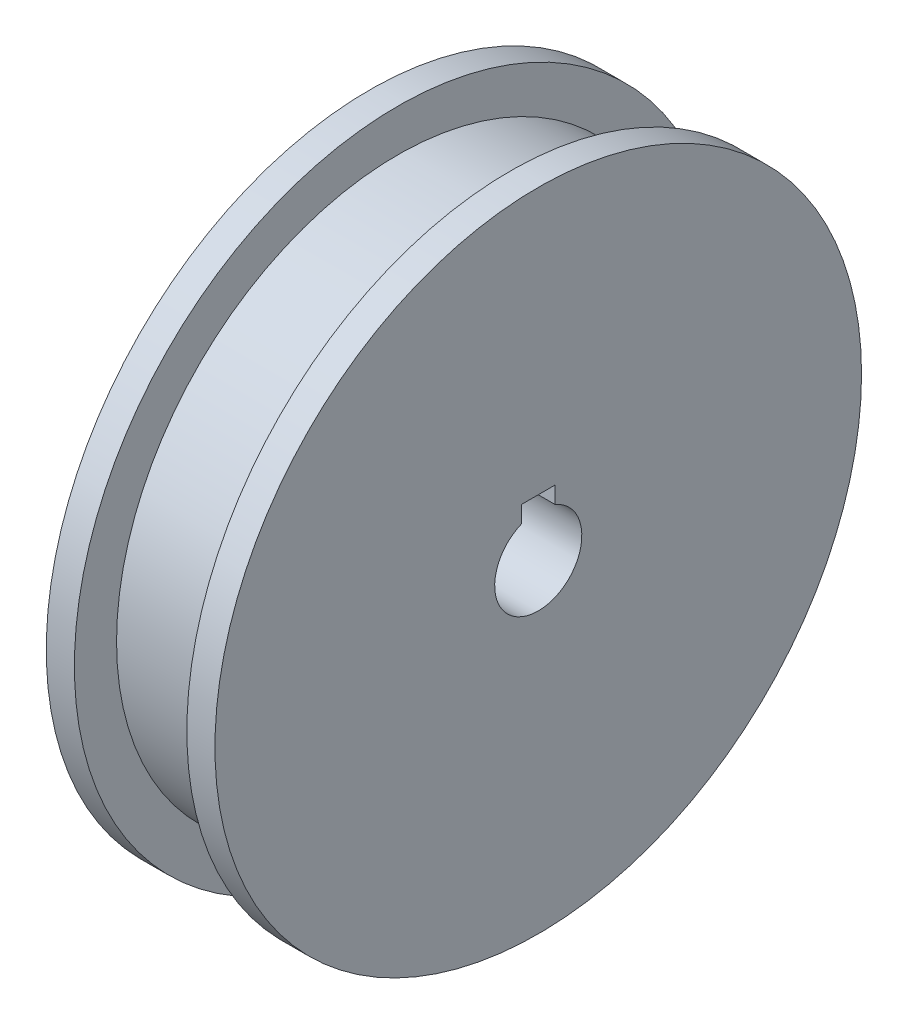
ISO-10303-21;
HEADER;
FILE_DESCRIPTION(('STEP AP214'),'2;1');
FILE_NAME('part.step','',(''),(''),'','','');
FILE_SCHEMA(('AUTOMOTIVE_DESIGN { 1 0 10303 214 1 1 1 1 }'));
ENDSEC;
DATA;
#1=APPLICATION_CONTEXT('core data for automotive mechanical design processes');
#2=APPLICATION_PROTOCOL_DEFINITION('international standard','automotive_design',2000,#1);
#3=PRODUCT_CONTEXT('',#1,'mechanical');
#4=PRODUCT('Part','Part','',(#3));
#5=PRODUCT_RELATED_PRODUCT_CATEGORY('part','',(#4));
#6=PRODUCT_DEFINITION_FORMATION('','',#4);
#7=PRODUCT_DEFINITION_CONTEXT('part definition',#1,'design');
#8=PRODUCT_DEFINITION('design','',#6,#7);
#9=PRODUCT_DEFINITION_SHAPE('','',#8);
#10=(LENGTH_UNIT() NAMED_UNIT(*) SI_UNIT(.MILLI.,.METRE.));
#11=(NAMED_UNIT(*) PLANE_ANGLE_UNIT() SI_UNIT($,.RADIAN.));
#12=(NAMED_UNIT(*) SI_UNIT($,.STERADIAN.) SOLID_ANGLE_UNIT());
#13=UNCERTAINTY_MEASURE_WITH_UNIT(LENGTH_MEASURE(1.E-05),#10,'distance_accuracy_value','');
#14=(GEOMETRIC_REPRESENTATION_CONTEXT(3) GLOBAL_UNCERTAINTY_ASSIGNED_CONTEXT((#13)) GLOBAL_UNIT_ASSIGNED_CONTEXT((#10,
#11,#12)) REPRESENTATION_CONTEXT('',''));
#15=CARTESIAN_POINT('',(0.,0.,0.));
#16=DIRECTION('',(0.,0.,1.));
#17=DIRECTION('',(1.,0.,0.));
#18=AXIS2_PLACEMENT_3D('',#15,#16,#17);
#19=CARTESIAN_POINT('',(3.,0.,0.));
#20=DIRECTION('',(-1.,0.,0.));
#21=DIRECTION('',(0.,0.,1.));
#22=AXIS2_PLACEMENT_3D('',#19,#20,#21);
#23=CYLINDRICAL_SURFACE('',#22,10.);
#24=CARTESIAN_POINT('',(2.,0.,0.));
#25=DIRECTION('',(1.,0.,0.));
#26=DIRECTION('',(0.,0.,-1.));
#27=AXIS2_PLACEMENT_3D('',#24,#25,#26);
#28=CIRCLE('',#27,10.);
#29=CARTESIAN_POINT('',(2.,0.,-10.));
#30=VERTEX_POINT('',#29);
#31=EDGE_CURVE('E42',#30,#30,#28,.T.);
#32=ORIENTED_EDGE('',*,*,#31,.F.);
#33=EDGE_LOOP('',(#32));
#34=FACE_BOUND('',#33,.T.);
#35=CARTESIAN_POINT('',(-2.,0.,0.));
#36=DIRECTION('',(-1.,0.,0.));
#37=DIRECTION('',(0.,0.,1.));
#38=AXIS2_PLACEMENT_3D('',#35,#36,#37);
#39=CIRCLE('',#38,10.);
#40=CARTESIAN_POINT('',(-2.,0.,10.));
#41=VERTEX_POINT('',#40);
#42=EDGE_CURVE('E11',#41,#41,#39,.T.);
#43=ORIENTED_EDGE('',*,*,#42,.F.);
#44=EDGE_LOOP('',(#43));
#45=FACE_BOUND('',#44,.T.);
#46=ADVANCED_FACE('F35',(#34,#45),#23,.T.);
#47=CARTESIAN_POINT('',(2.,0.,0.));
#48=DIRECTION('',(1.,0.,0.));
#49=DIRECTION('',(0.,0.,-1.));
#50=AXIS2_PLACEMENT_3D('',#47,#48,#49);
#51=CYLINDRICAL_SURFACE('',#50,11.5);
#52=CARTESIAN_POINT('',(2.,0.,0.));
#53=DIRECTION('',(1.,0.,0.));
#54=DIRECTION('',(0.,0.,-1.));
#55=AXIS2_PLACEMENT_3D('',#52,#53,#54);
#56=CIRCLE('',#55,11.5);
#57=CARTESIAN_POINT('',(2.,0.,-11.5));
#58=VERTEX_POINT('',#57);
#59=EDGE_CURVE('E118',#58,#58,#56,.T.);
#60=ORIENTED_EDGE('',*,*,#59,.T.);
#61=EDGE_LOOP('',(#60));
#62=FACE_BOUND('',#61,.T.);
#63=CARTESIAN_POINT('',(3.,0.,0.));
#64=DIRECTION('',(1.,0.,0.));
#65=DIRECTION('',(0.,0.,-1.));
#66=AXIS2_PLACEMENT_3D('',#63,#64,#65);
#67=CIRCLE('',#66,11.5);
#68=CARTESIAN_POINT('',(3.,0.,-11.5));
#69=VERTEX_POINT('',#68);
#70=EDGE_CURVE('E115',#69,#69,#67,.T.);
#71=ORIENTED_EDGE('',*,*,#70,.F.);
#72=EDGE_LOOP('',(#71));
#73=FACE_BOUND('',#72,.T.);
#74=ADVANCED_FACE('F130',(#62,#73),#51,.T.);
#75=CARTESIAN_POINT('',(2.,0.,0.));
#76=DIRECTION('',(1.,0.,0.));
#77=DIRECTION('',(0.,0.,-1.));
#78=AXIS2_PLACEMENT_3D('',#75,#76,#77);
#79=PLANE('',#78);
#80=ORIENTED_EDGE('',*,*,#31,.T.);
#81=EDGE_LOOP('',(#80));
#82=FACE_BOUND('',#81,.T.);
#83=ORIENTED_EDGE('',*,*,#59,.F.);
#84=EDGE_LOOP('',(#83));
#85=FACE_BOUND('',#84,.T.);
#86=ADVANCED_FACE('F125',(#82,#85),#79,.F.);
#87=CARTESIAN_POINT('',(3.,0.,0.));
#88=DIRECTION('',(1.,0.,0.));
#89=DIRECTION('',(0.,0.,-1.));
#90=AXIS2_PLACEMENT_3D('',#87,#88,#89);
#91=PLANE('',#90);
#92=DIRECTION('',(0.,-1.,0.));
#93=VECTOR('',#92,1.);
#94=CARTESIAN_POINT('',(3.,2.02916059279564,0.6));
#95=LINE('',#94,#93);
#96=CARTESIAN_POINT('',(3.,2.02916059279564,0.6));
#97=VERTEX_POINT('',#96);
#98=CARTESIAN_POINT('',(3.,1.42916059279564,0.6));
#99=VERTEX_POINT('',#98);
#100=EDGE_CURVE('E49',#97,#99,#95,.T.);
#101=ORIENTED_EDGE('',*,*,#100,.F.);
#102=DIRECTION('',(0.,0.,1.));
#103=VECTOR('',#102,1.);
#104=CARTESIAN_POINT('',(3.,2.02916059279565,-0.6));
#105=LINE('',#104,#103);
#106=CARTESIAN_POINT('',(3.,2.02916059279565,-0.6));
#107=VERTEX_POINT('',#106);
#108=EDGE_CURVE('E93',#107,#97,#105,.T.);
#109=ORIENTED_EDGE('',*,*,#108,.F.);
#110=DIRECTION('',(0.,1.,0.));
#111=VECTOR('',#110,1.);
#112=CARTESIAN_POINT('',(3.,2.02916059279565,-0.6));
#113=LINE('',#112,#111);
#114=CARTESIAN_POINT('',(3.,1.42916059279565,-0.6));
#115=VERTEX_POINT('',#114);
#116=EDGE_CURVE('E96',#115,#107,#113,.T.);
#117=ORIENTED_EDGE('',*,*,#116,.F.);
#118=CARTESIAN_POINT('',(3.,0.,0.));
#119=DIRECTION('',(1.,0.,0.));
#120=DIRECTION('',(0.,0.,-1.));
#121=AXIS2_PLACEMENT_3D('',#118,#119,#120);
#122=CIRCLE('',#121,1.55);
#123=EDGE_CURVE('E102',#99,#115,#122,.T.);
#124=ORIENTED_EDGE('',*,*,#123,.F.);
#125=EDGE_LOOP('',(#101,#109,#117,#124));
#126=FACE_BOUND('',#125,.T.);
#127=ORIENTED_EDGE('',*,*,#70,.T.);
#128=EDGE_LOOP('',(#127));
#129=FACE_BOUND('',#128,.T.);
#130=ADVANCED_FACE('F136',(#126,#129),#91,.T.);
#131=CARTESIAN_POINT('',(-2.,0.,0.));
#132=DIRECTION('',(-1.,0.,0.));
#133=DIRECTION('',(0.,0.,-1.));
#134=AXIS2_PLACEMENT_3D('',#131,#132,#133);
#135=PLANE('',#134);
#136=CARTESIAN_POINT('',(-2.,0.,0.));
#137=DIRECTION('',(1.,0.,0.));
#138=DIRECTION('',(0.,0.,-1.));
#139=AXIS2_PLACEMENT_3D('',#136,#137,#138);
#140=CIRCLE('',#139,11.5);
#141=CARTESIAN_POINT('',(-2.,0.,-11.5));
#142=VERTEX_POINT('',#141);
#143=EDGE_CURVE('E112',#142,#142,#140,.T.);
#144=ORIENTED_EDGE('',*,*,#143,.T.);
#145=EDGE_LOOP('',(#144));
#146=FACE_BOUND('',#145,.T.);
#147=ORIENTED_EDGE('',*,*,#42,.T.);
#148=EDGE_LOOP('',(#147));
#149=FACE_BOUND('',#148,.T.);
#150=ADVANCED_FACE('F133',(#146,#149),#135,.F.);
#151=CARTESIAN_POINT('',(-2.,0.,0.));
#152=DIRECTION('',(-1.,0.,0.));
#153=DIRECTION('',(0.,0.,1.));
#154=AXIS2_PLACEMENT_3D('',#151,#152,#153);
#155=CYLINDRICAL_SURFACE('',#154,11.5);
#156=ORIENTED_EDGE('',*,*,#143,.F.);
#157=EDGE_LOOP('',(#156));
#158=FACE_BOUND('',#157,.T.);
#159=CARTESIAN_POINT('',(-3.,0.,0.));
#160=DIRECTION('',(1.,0.,0.));
#161=DIRECTION('',(0.,0.,-1.));
#162=AXIS2_PLACEMENT_3D('',#159,#160,#161);
#163=CIRCLE('',#162,11.5);
#164=CARTESIAN_POINT('',(-3.,0.,-11.5));
#165=VERTEX_POINT('',#164);
#166=EDGE_CURVE('E108',#165,#165,#163,.T.);
#167=ORIENTED_EDGE('',*,*,#166,.T.);
#168=EDGE_LOOP('',(#167));
#169=FACE_BOUND('',#168,.T.);
#170=ADVANCED_FACE('F135',(#158,#169),#155,.T.);
#171=CARTESIAN_POINT('',(-3.,0.,0.));
#172=DIRECTION('',(1.,0.,0.));
#173=DIRECTION('',(0.,0.,-1.));
#174=AXIS2_PLACEMENT_3D('',#171,#172,#173);
#175=PLANE('',#174);
#176=DIRECTION('',(0.,0.,1.));
#177=VECTOR('',#176,1.);
#178=CARTESIAN_POINT('',(-3.,2.02916059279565,-0.6));
#179=LINE('',#178,#177);
#180=CARTESIAN_POINT('',(-3.,2.02916059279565,-0.6));
#181=VERTEX_POINT('',#180);
#182=CARTESIAN_POINT('',(-3.,2.02916059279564,0.6));
#183=VERTEX_POINT('',#182);
#184=EDGE_CURVE('E83',#181,#183,#179,.T.);
#185=ORIENTED_EDGE('',*,*,#184,.T.);
#186=DIRECTION('',(0.,-1.,0.));
#187=VECTOR('',#186,1.);
#188=CARTESIAN_POINT('',(-3.,2.02916059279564,0.6));
#189=LINE('',#188,#187);
#190=CARTESIAN_POINT('',(-3.,1.42916059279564,0.6));
#191=VERTEX_POINT('',#190);
#192=EDGE_CURVE('E77',#183,#191,#189,.T.);
#193=ORIENTED_EDGE('',*,*,#192,.T.);
#194=CARTESIAN_POINT('',(-3.,0.,0.));
#195=DIRECTION('',(1.,0.,0.));
#196=DIRECTION('',(0.,0.,-1.));
#197=AXIS2_PLACEMENT_3D('',#194,#195,#196);
#198=CIRCLE('',#197,1.55);
#199=CARTESIAN_POINT('',(-3.,1.42916059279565,-0.6));
#200=VERTEX_POINT('',#199);
#201=EDGE_CURVE('E86',#191,#200,#198,.T.);
#202=ORIENTED_EDGE('',*,*,#201,.T.);
#203=DIRECTION('',(0.,1.,0.));
#204=VECTOR('',#203,1.);
#205=CARTESIAN_POINT('',(-3.,2.02916059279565,-0.6));
#206=LINE('',#205,#204);
#207=EDGE_CURVE('E57',#200,#181,#206,.T.);
#208=ORIENTED_EDGE('',*,*,#207,.T.);
#209=EDGE_LOOP('',(#185,#193,#202,#208));
#210=FACE_BOUND('',#209,.T.);
#211=ORIENTED_EDGE('',*,*,#166,.F.);
#212=EDGE_LOOP('',(#211));
#213=FACE_BOUND('',#212,.T.);
#214=ADVANCED_FACE('F90',(#210,#213),#175,.F.);
#215=CARTESIAN_POINT('',(-3.,2.02916059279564,0.6));
#216=DIRECTION('',(0.,0.,1.));
#217=DIRECTION('',(0.,-1.,0.));
#218=AXIS2_PLACEMENT_3D('',#215,#216,#217);
#219=PLANE('',#218);
#220=ORIENTED_EDGE('',*,*,#100,.T.);
#221=DIRECTION('',(1.,0.,0.));
#222=VECTOR('',#221,1.);
#223=CARTESIAN_POINT('',(-3.,1.42916059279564,0.6));
#224=LINE('',#223,#222);
#225=EDGE_CURVE('E73',#191,#99,#224,.T.);
#226=ORIENTED_EDGE('',*,*,#225,.F.);
#227=ORIENTED_EDGE('',*,*,#192,.F.);
#228=DIRECTION('',(1.,0.,0.));
#229=VECTOR('',#228,1.);
#230=CARTESIAN_POINT('',(-3.,2.02916059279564,0.6));
#231=LINE('',#230,#229);
#232=EDGE_CURVE('E106',#183,#97,#231,.T.);
#233=ORIENTED_EDGE('',*,*,#232,.T.);
#234=EDGE_LOOP('',(#220,#226,#227,#233));
#235=FACE_BOUND('',#234,.T.);
#236=ADVANCED_FACE('F75',(#235),#219,.F.);
#237=CARTESIAN_POINT('',(-3.,2.02916059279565,-0.6));
#238=DIRECTION('',(0.,1.,0.));
#239=DIRECTION('',(0.,0.,1.));
#240=AXIS2_PLACEMENT_3D('',#237,#238,#239);
#241=PLANE('',#240);
#242=ORIENTED_EDGE('',*,*,#108,.T.);
#243=ORIENTED_EDGE('',*,*,#232,.F.);
#244=ORIENTED_EDGE('',*,*,#184,.F.);
#245=DIRECTION('',(1.,0.,0.));
#246=VECTOR('',#245,1.);
#247=CARTESIAN_POINT('',(-3.,2.02916059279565,-0.6));
#248=LINE('',#247,#246);
#249=EDGE_CURVE('E109',#181,#107,#248,.T.);
#250=ORIENTED_EDGE('',*,*,#249,.T.);
#251=EDGE_LOOP('',(#242,#243,#244,#250));
#252=FACE_BOUND('',#251,.T.);
#253=ADVANCED_FACE('F158',(#252),#241,.F.);
#254=CARTESIAN_POINT('',(-3.,2.02916059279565,-0.6));
#255=DIRECTION('',(0.,0.,-1.));
#256=DIRECTION('',(0.,1.,0.));
#257=AXIS2_PLACEMENT_3D('',#254,#255,#256);
#258=PLANE('',#257);
#259=ORIENTED_EDGE('',*,*,#116,.T.);
#260=ORIENTED_EDGE('',*,*,#249,.F.);
#261=ORIENTED_EDGE('',*,*,#207,.F.);
#262=DIRECTION('',(1.,0.,0.));
#263=VECTOR('',#262,1.);
#264=CARTESIAN_POINT('',(-3.,1.42916059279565,-0.6));
#265=LINE('',#264,#263);
#266=EDGE_CURVE('E82',#200,#115,#265,.T.);
#267=ORIENTED_EDGE('',*,*,#266,.T.);
#268=EDGE_LOOP('',(#259,#260,#261,#267));
#269=FACE_BOUND('',#268,.T.);
#270=ADVANCED_FACE('F162',(#269),#258,.F.);
#271=CARTESIAN_POINT('',(-3.,0.,0.));
#272=DIRECTION('',(1.,0.,0.));
#273=DIRECTION('',(0.,0.,-1.));
#274=AXIS2_PLACEMENT_3D('',#271,#272,#273);
#275=CYLINDRICAL_SURFACE('',#274,1.55);
#276=ORIENTED_EDGE('',*,*,#123,.T.);
#277=ORIENTED_EDGE('',*,*,#266,.F.);
#278=ORIENTED_EDGE('',*,*,#201,.F.);
#279=ORIENTED_EDGE('',*,*,#225,.T.);
#280=EDGE_LOOP('',(#276,#277,#278,#279));
#281=FACE_BOUND('',#280,.T.);
#282=ADVANCED_FACE('F87',(#281),#275,.F.);
#283=CLOSED_SHELL('',(#46,#74,#86,#130,#150,#170,#214,#236,#253,#270,#282));
#284=MANIFOLD_SOLID_BREP('B2',#283);
#285=ADVANCED_BREP_SHAPE_REPRESENTATION('',(#18,#284),#14);
#286=SHAPE_DEFINITION_REPRESENTATION(#9,#285);
ENDSEC;
END-ISO-10303-21;
